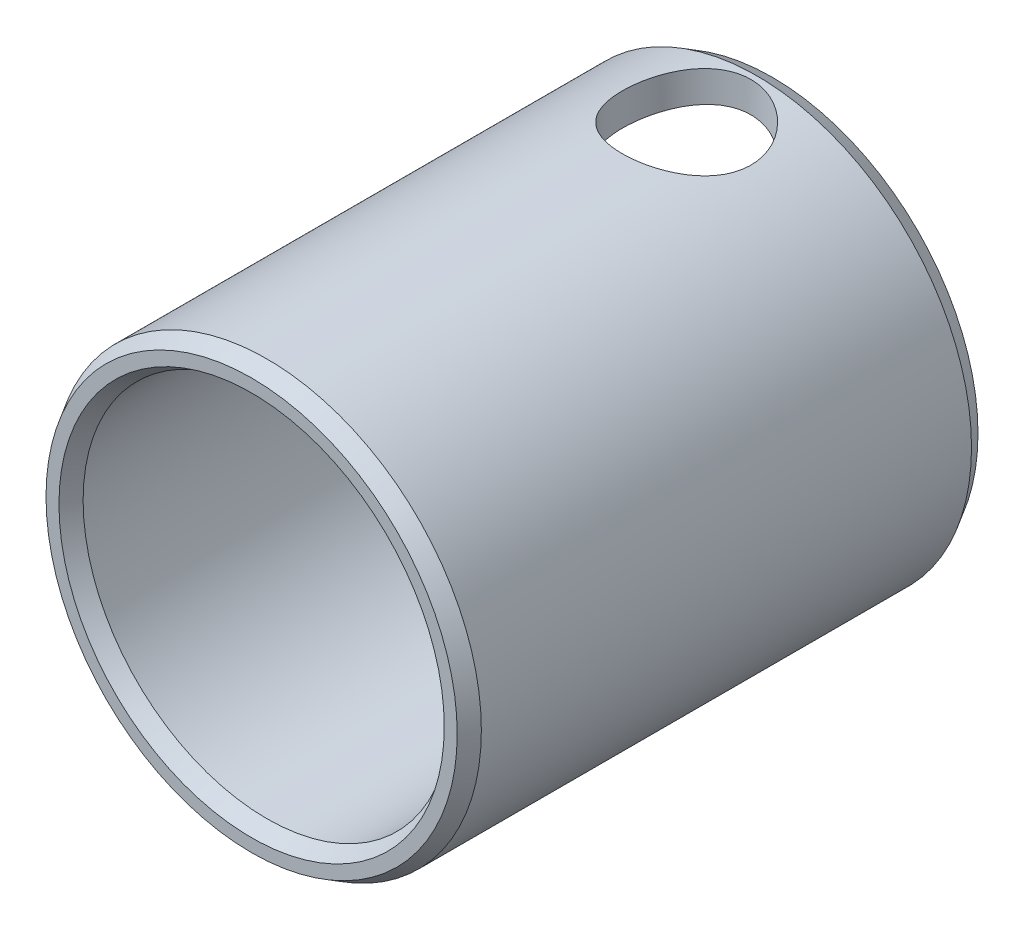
ISO-10303-21;
HEADER;
FILE_DESCRIPTION(('STEP AP214'),'2;1');
FILE_NAME('part.step','',(''),(''),'','','');
FILE_SCHEMA(('AUTOMOTIVE_DESIGN { 1 0 10303 214 1 1 1 1 }'));
ENDSEC;
DATA;
#1=APPLICATION_CONTEXT('core data for automotive mechanical design processes');
#2=APPLICATION_PROTOCOL_DEFINITION('international standard','automotive_design',2000,#1);
#3=PRODUCT_CONTEXT('',#1,'mechanical');
#4=PRODUCT('Part','Part','',(#3));
#5=PRODUCT_RELATED_PRODUCT_CATEGORY('part','',(#4));
#6=PRODUCT_DEFINITION_FORMATION('','',#4);
#7=PRODUCT_DEFINITION_CONTEXT('part definition',#1,'design');
#8=PRODUCT_DEFINITION('design','',#6,#7);
#9=PRODUCT_DEFINITION_SHAPE('','',#8);
#10=(LENGTH_UNIT() NAMED_UNIT(*) SI_UNIT(.MILLI.,.METRE.));
#11=(NAMED_UNIT(*) PLANE_ANGLE_UNIT() SI_UNIT($,.RADIAN.));
#12=(NAMED_UNIT(*) SI_UNIT($,.STERADIAN.) SOLID_ANGLE_UNIT());
#13=UNCERTAINTY_MEASURE_WITH_UNIT(LENGTH_MEASURE(1.E-05),#10,'distance_accuracy_value','');
#14=(GEOMETRIC_REPRESENTATION_CONTEXT(3) GLOBAL_UNCERTAINTY_ASSIGNED_CONTEXT((#13)) GLOBAL_UNIT_ASSIGNED_CONTEXT((#10,
#11,#12)) REPRESENTATION_CONTEXT('',''));
#15=CARTESIAN_POINT('',(0.,0.,0.));
#16=DIRECTION('',(0.,0.,1.));
#17=DIRECTION('',(1.,0.,0.));
#18=AXIS2_PLACEMENT_3D('',#15,#16,#17);
#19=CARTESIAN_POINT('',(0.,0.,18.6351157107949));
#20=DIRECTION('',(0.,0.,1.));
#21=DIRECTION('',(1.,0.,0.));
#22=AXIS2_PLACEMENT_3D('',#19,#20,#21);
#23=CYLINDRICAL_SURFACE('',#22,7.);
#24=CARTESIAN_POINT('',(0.,0.,16.5));
#25=DIRECTION('',(0.,0.,1.));
#26=DIRECTION('',(1.,0.,0.));
#27=AXIS2_PLACEMENT_3D('',#24,#25,#26);
#28=CIRCLE('',#27,7.);
#29=CARTESIAN_POINT('',(7.,0.,16.5));
#30=VERTEX_POINT('',#29);
#31=EDGE_CURVE('E29',#30,#30,#28,.T.);
#32=ORIENTED_EDGE('',*,*,#31,.F.);
#33=EDGE_LOOP('',(#32));
#34=FACE_BOUND('',#33,.T.);
#35=CARTESIAN_POINT('',(0.,0.,0.5));
#36=DIRECTION('',(0.,0.,1.));
#37=DIRECTION('',(1.,0.,0.));
#38=AXIS2_PLACEMENT_3D('',#35,#36,#37);
#39=CIRCLE('',#38,7.);
#40=CARTESIAN_POINT('',(7.,0.,0.5));
#41=VERTEX_POINT('',#40);
#42=EDGE_CURVE('E25',#41,#41,#39,.T.);
#43=ORIENTED_EDGE('',*,*,#42,.T.);
#44=EDGE_LOOP('',(#43));
#45=FACE_BOUND('',#44,.T.);
#46=CARTESIAN_POINT('',(0.,7.,4.9));
#47=CARTESIAN_POINT('',(0.11520405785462,6.9999990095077,4.89999860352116));
#48=CARTESIAN_POINT('',(0.230422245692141,6.99712881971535,4.89048859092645));
#49=CARTESIAN_POINT('',(0.457503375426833,6.98595947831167,4.85279010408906));
#50=CARTESIAN_POINT('',(0.569365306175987,6.97765870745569,4.82459605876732));
#51=CARTESIAN_POINT('',(0.786425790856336,6.95653773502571,4.75055557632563));
#52=CARTESIAN_POINT('',(0.891633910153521,6.94372420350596,4.70473518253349));
#53=CARTESIAN_POINT('',(1.09287385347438,6.91490952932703,4.59684946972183));
#54=CARTESIAN_POINT('',(1.18890445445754,6.89890796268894,4.53478198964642));
#55=CARTESIAN_POINT('',(1.37182051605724,6.86491032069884,4.39428638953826));
#56=CARTESIAN_POINT('',(1.45840529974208,6.84687337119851,4.31547672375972));
#57=CARTESIAN_POINT('',(1.61734889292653,6.81108167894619,4.14454707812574));
#58=CARTESIAN_POINT('',(1.68970530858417,6.79332698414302,4.05242486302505));
#59=CARTESIAN_POINT('',(1.81972052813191,6.75967759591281,3.85494094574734));
#60=CARTESIAN_POINT('',(1.87701232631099,6.74383369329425,3.74932815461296));
#61=CARTESIAN_POINT('',(1.97289952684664,6.71641068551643,3.52941504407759));
#62=CARTESIAN_POINT('',(2.01149941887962,6.70483055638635,3.41511681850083));
#63=CARTESIAN_POINT('',(2.06782287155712,6.68767219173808,3.18445362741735));
#64=CARTESIAN_POINT('',(2.08610074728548,6.68193497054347,3.06823615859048));
#65=CARTESIAN_POINT('',(2.10299222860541,6.67663905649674,2.83425358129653));
#66=CARTESIAN_POINT('',(2.1016105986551,6.677078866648,2.71648885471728));
#67=CARTESIAN_POINT('',(2.07965768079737,6.68394641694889,2.48726252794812));
#68=CARTESIAN_POINT('',(2.05978087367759,6.69015744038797,2.37572684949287));
#69=CARTESIAN_POINT('',(2.00252388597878,6.70751698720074,2.15765229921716));
#70=CARTESIAN_POINT('',(1.96514197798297,6.71866599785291,2.05111392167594));
#71=CARTESIAN_POINT('',(1.87342437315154,6.74481826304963,1.84435951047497));
#72=CARTESIAN_POINT('',(1.81886343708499,6.75987222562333,1.74425008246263));
#73=CARTESIAN_POINT('',(1.69449311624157,6.7921138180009,1.55437516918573));
#74=CARTESIAN_POINT('',(1.62468003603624,6.80930196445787,1.46461219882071));
#75=CARTESIAN_POINT('',(1.46833807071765,6.84475415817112,1.29403933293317));
#76=CARTESIAN_POINT('',(1.38123287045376,6.86303316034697,1.21375987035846));
#77=CARTESIAN_POINT('',(1.19456856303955,6.89797141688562,1.06882442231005));
#78=CARTESIAN_POINT('',(1.09500867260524,6.91463056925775,1.0041694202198));
#79=CARTESIAN_POINT('',(0.885297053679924,6.94460424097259,0.891996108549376));
#80=CARTESIAN_POINT('',(0.775078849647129,6.9578956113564,0.844595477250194));
#81=CARTESIAN_POINT('',(0.547743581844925,6.97946930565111,0.769160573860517));
#82=CARTESIAN_POINT('',(0.430628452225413,6.98775302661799,0.741120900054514));
#83=CARTESIAN_POINT('',(0.197333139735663,6.99815710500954,0.706086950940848));
#84=CARTESIAN_POINT('',(0.0812701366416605,7.00048790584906,0.698373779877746));
#85=CARTESIAN_POINT('',(-0.150499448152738,6.99934092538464,0.702196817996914));
#86=CARTESIAN_POINT('',(-0.266206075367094,6.9958639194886,0.713730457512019));
#87=CARTESIAN_POINT('',(-0.491265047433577,6.98362975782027,0.755138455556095));
#88=CARTESIAN_POINT('',(-0.600701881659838,6.9749936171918,0.784592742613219));
#89=CARTESIAN_POINT('',(-0.813056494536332,6.95344086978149,0.860500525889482));
#90=CARTESIAN_POINT('',(-0.91597348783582,6.94052374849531,0.906956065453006));
#91=CARTESIAN_POINT('',(-1.11501206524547,6.91137516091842,1.01675443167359));
#92=CARTESIAN_POINT('',(-1.21092135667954,6.89507393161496,1.08046307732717));
#93=CARTESIAN_POINT('',(-1.39093263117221,6.86102856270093,1.22251465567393));
#94=CARTESIAN_POINT('',(-1.47503164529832,6.84328406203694,1.30086125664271));
#95=CARTESIAN_POINT('',(-1.63220042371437,6.80754440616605,1.47334223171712));
#96=CARTESIAN_POINT('',(-1.70475873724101,6.78956355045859,1.56794662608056));
#97=CARTESIAN_POINT('',(-1.83300593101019,6.75607121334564,1.76837911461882));
#98=CARTESIAN_POINT('',(-1.88869525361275,6.74055966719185,1.87420691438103));
#99=CARTESIAN_POINT('',(-1.98124285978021,6.71394065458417,2.09374548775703));
#100=CARTESIAN_POINT('',(-2.01818885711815,6.70281272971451,2.20741666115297));
#101=CARTESIAN_POINT('',(-2.07230423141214,6.68628232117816,2.43976315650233));
#102=CARTESIAN_POINT('',(-2.08948038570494,6.68087787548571,2.55843674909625));
#103=CARTESIAN_POINT('',(-2.10310778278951,6.6765996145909,2.79210612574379));
#104=CARTESIAN_POINT('',(-2.10039277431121,6.67746306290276,2.90704911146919));
#105=CARTESIAN_POINT('',(-2.07630507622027,6.68499161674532,3.13475974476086));
#106=CARTESIAN_POINT('',(-2.05493313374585,6.69165648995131,3.24752747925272));
#107=CARTESIAN_POINT('',(-1.9946764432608,6.7098606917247,3.46632355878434));
#108=CARTESIAN_POINT('',(-1.95601245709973,6.72133846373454,3.57241820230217));
#109=CARTESIAN_POINT('',(-1.86244109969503,6.74786390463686,3.77669941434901));
#110=CARTESIAN_POINT('',(-1.80753061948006,6.76291225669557,3.8748844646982));
#111=CARTESIAN_POINT('',(-1.68068269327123,6.79556746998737,4.06442836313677));
#112=CARTESIAN_POINT('',(-1.60819786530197,6.81324756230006,4.15540826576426));
#113=CARTESIAN_POINT('',(-1.44924408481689,6.84881848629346,4.32418349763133));
#114=CARTESIAN_POINT('',(-1.36277150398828,6.8667093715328,4.40197539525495));
#115=CARTESIAN_POINT('',(-1.17525206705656,6.90131311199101,4.54443277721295));
#116=CARTESIAN_POINT('',(-1.07385304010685,6.91797623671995,4.60864802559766));
#117=CARTESIAN_POINT('',(-0.861197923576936,6.94764952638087,4.71902923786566));
#118=CARTESIAN_POINT('',(-0.749946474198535,6.9606613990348,4.76520364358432));
#119=CARTESIAN_POINT('',(-0.533060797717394,6.98043044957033,4.83405338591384));
#120=CARTESIAN_POINT('',(-0.428101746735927,6.98770838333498,4.85871634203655));
#121=CARTESIAN_POINT('',(-0.21543227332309,6.99749322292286,4.89168893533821));
#122=CARTESIAN_POINT('',(-0.107722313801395,7.00000092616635,4.90000130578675));
#123=CARTESIAN_POINT('',(0.,7.,4.9));
#124=B_SPLINE_CURVE_WITH_KNOTS('',3,(#46,#47,#48,#49,#50,#51,#52,#53,#54,#55,#56,#57,#58,#59,
#60,#61,#62,#63,#64,#65,#66,#67,#68,#69,#70,#71,#72,#73,#74,#75,#76,#77,#78,#79,#80,#81,#82,#83,
#84,#85,#86,#87,#88,#89,#90,#91,#92,#93,#94,#95,#96,#97,#98,#99,#100,#101,#102,#103,#104,#105,
#106,#107,#108,#109,#110,#111,#112,#113,#114,#115,#116,#117,#118,#119,#120,#121,#122,#123),
.UNSPECIFIED.,.T.,.F.,(4,2,2,2,2,2,2,2,2,2,2,2,2,2,2,2,2,2,2,2,2,2,2,2,2,2,2,2,2,2,2,2,2,2,2,2,
2,2,4),(0.,0.345216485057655,0.690535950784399,1.03534714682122,1.38020423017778,
1.73397844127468,2.08781212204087,2.44960073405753,2.81130240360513,3.16287565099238,
3.51436369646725,3.85316423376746,4.19199821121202,4.53547397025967,4.87903304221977,
5.23693945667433,5.594868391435,5.95519465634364,6.31542034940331,6.66272333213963,
7.00997994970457,7.34939445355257,7.6888497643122,8.03615827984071,8.38355394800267,
8.74356560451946,9.10356781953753,9.46186940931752,9.82004813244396,10.1633021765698,
10.5065424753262,10.8455205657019,11.1845635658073,11.5359569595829,11.8874416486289,
12.2492019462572,12.6107927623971,12.9336436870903,13.2564406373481),.UNSPECIFIED.);
#125=CARTESIAN_POINT('',(0.,7.,4.9));
#126=VERTEX_POINT('',#125);
#127=EDGE_CURVE('E49',#126,#126,#124,.T.);
#128=ORIENTED_EDGE('',*,*,#127,.F.);
#129=EDGE_LOOP('',(#128));
#130=FACE_BOUND('',#129,.T.);
#131=ADVANCED_FACE('F12',(#34,#45,#130),#23,.T.);
#132=CARTESIAN_POINT('',(0.,0.,18.6351157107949));
#133=DIRECTION('',(0.,0.,1.));
#134=DIRECTION('',(1.,0.,0.));
#135=AXIS2_PLACEMENT_3D('',#132,#133,#134);
#136=CYLINDRICAL_SURFACE('',#135,6.);
#137=CARTESIAN_POINT('',(0.,0.,16.5));
#138=DIRECTION('',(0.,0.,1.));
#139=DIRECTION('',(1.,0.,0.));
#140=AXIS2_PLACEMENT_3D('',#137,#138,#139);
#141=CIRCLE('',#140,6.);
#142=CARTESIAN_POINT('',(6.,0.,16.5));
#143=VERTEX_POINT('',#142);
#144=EDGE_CURVE('E40',#143,#143,#141,.T.);
#145=ORIENTED_EDGE('',*,*,#144,.T.);
#146=EDGE_LOOP('',(#145));
#147=FACE_BOUND('',#146,.T.);
#148=CARTESIAN_POINT('',(0.,0.,0.5));
#149=DIRECTION('',(0.,0.,1.));
#150=DIRECTION('',(1.,0.,0.));
#151=AXIS2_PLACEMENT_3D('',#148,#149,#150);
#152=CIRCLE('',#151,6.);
#153=CARTESIAN_POINT('',(6.,0.,0.5));
#154=VERTEX_POINT('',#153);
#155=EDGE_CURVE('E43',#154,#154,#152,.T.);
#156=ORIENTED_EDGE('',*,*,#155,.F.);
#157=EDGE_LOOP('',(#156));
#158=FACE_BOUND('',#157,.T.);
#159=CARTESIAN_POINT('',(0.,6.,4.9));
#160=CARTESIAN_POINT('',(-0.114251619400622,6.00000124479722,4.90000177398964));
#161=CARTESIAN_POINT('',(-0.228490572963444,5.99670718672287,4.89064619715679));
#162=CARTESIAN_POINT('',(-0.453584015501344,5.98389272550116,4.85359972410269));
#163=CARTESIAN_POINT('',(-0.564438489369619,5.97437229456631,4.82590874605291));
#164=CARTESIAN_POINT('',(-0.779485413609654,5.95013476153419,4.75327063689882));
#165=CARTESIAN_POINT('',(-0.88368929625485,5.9354268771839,4.70835410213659));
#166=CARTESIAN_POINT('',(-1.0830819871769,5.9023013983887,4.60268493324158));
#167=CARTESIAN_POINT('',(-1.17826873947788,5.88388296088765,4.54192869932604));
#168=CARTESIAN_POINT('',(-1.36051553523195,5.8444837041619,4.40390289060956));
#169=CARTESIAN_POINT('',(-1.44718917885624,5.82343705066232,4.32614204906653));
#170=CARTESIAN_POINT('',(-1.60656711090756,5.78150036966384,4.15735799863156));
#171=CARTESIAN_POINT('',(-1.67926788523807,5.76061038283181,4.06633146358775));
#172=CARTESIAN_POINT('',(-1.81093773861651,5.72061212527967,3.8700072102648));
#173=CARTESIAN_POINT('',(-1.86938779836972,5.70158313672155,3.76434366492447));
#174=CARTESIAN_POINT('',(-1.96751959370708,5.66847146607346,3.54391324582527));
#175=CARTESIAN_POINT('',(-2.00720773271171,5.65438709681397,3.42914949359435));
#176=CARTESIAN_POINT('',(-2.0652098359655,5.63345661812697,3.198194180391));
#177=CARTESIAN_POINT('',(-2.08425340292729,5.62636429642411,3.08220886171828));
#178=CARTESIAN_POINT('',(-2.10270718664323,5.61949543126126,2.8484889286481));
#179=CARTESIAN_POINT('',(-2.10212422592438,5.61971634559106,2.73075493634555));
#180=CARTESIAN_POINT('',(-2.08190459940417,5.62723456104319,2.50327032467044));
#181=CARTESIAN_POINT('',(-2.06324229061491,5.63416998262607,2.39341901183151));
#182=CARTESIAN_POINT('',(-2.008991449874,5.65374002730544,2.17851855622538));
#183=CARTESIAN_POINT('',(-1.97340069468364,5.66637539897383,2.07347004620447));
#184=CARTESIAN_POINT('',(-1.88570622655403,5.69616366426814,1.86903257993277));
#185=CARTESIAN_POINT('',(-1.83332799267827,5.71339079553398,1.76977266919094));
#186=CARTESIAN_POINT('',(-1.71373613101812,5.750392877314,1.58115283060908));
#187=CARTESIAN_POINT('',(-1.64651787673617,5.77016862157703,1.49179600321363));
#188=CARTESIAN_POINT('',(-1.49456039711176,5.81143944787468,1.32007406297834));
#189=CARTESIAN_POINT('',(-1.4090316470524,5.83296775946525,1.23841405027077));
#190=CARTESIAN_POINT('',(-1.22523410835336,5.87432244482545,1.09040207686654));
#191=CARTESIAN_POINT('',(-1.12696383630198,5.89414861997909,1.02405190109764));
#192=CARTESIAN_POINT('',(-0.918860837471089,5.93017388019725,0.907896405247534));
#193=CARTESIAN_POINT('',(-0.808904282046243,5.94632692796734,0.858297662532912));
#194=CARTESIAN_POINT('',(-0.581505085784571,5.97284929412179,0.778526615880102));
#195=CARTESIAN_POINT('',(-0.464065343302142,5.98322083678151,0.748346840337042));
#196=CARTESIAN_POINT('',(-0.230989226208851,5.99663436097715,0.709560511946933));
#197=CARTESIAN_POINT('',(-0.115529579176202,5.99999933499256,0.700002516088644));
#198=CARTESIAN_POINT('',(0.115377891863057,6.00000066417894,0.699997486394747));
#199=CARTESIAN_POINT('',(0.230825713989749,5.99663828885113,0.709546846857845));
#200=CARTESIAN_POINT('',(0.454507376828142,5.98377619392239,0.746743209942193));
#201=CARTESIAN_POINT('',(0.562853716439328,5.97447978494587,0.773791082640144));
#202=CARTESIAN_POINT('',(0.773415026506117,5.95088754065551,0.844452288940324));
#203=CARTESIAN_POINT('',(0.875629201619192,5.93659105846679,0.888067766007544));
#204=CARTESIAN_POINT('',(1.0741840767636,5.90394255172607,0.991954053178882));
#205=CARTESIAN_POINT('',(1.17028394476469,5.88548924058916,1.05265239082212));
#206=CARTESIAN_POINT('',(1.35123467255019,5.84660110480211,1.18848710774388));
#207=CARTESIAN_POINT('',(1.43608178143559,5.82616562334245,1.26362828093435));
#208=CARTESIAN_POINT('',(1.59657189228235,5.78430503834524,1.43068012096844));
#209=CARTESIAN_POINT('',(1.67153670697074,5.76288189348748,1.52324446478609));
#210=CARTESIAN_POINT('',(1.80497245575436,5.72249507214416,1.7200875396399));
#211=CARTESIAN_POINT('',(1.86344281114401,5.70353148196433,1.82436668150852));
#212=CARTESIAN_POINT('',(1.96206588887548,5.67036332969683,2.0420003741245));
#213=CARTESIAN_POINT('',(2.00221823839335,5.65615886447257,2.15535510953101));
#214=CARTESIAN_POINT('',(2.06265099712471,5.63440525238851,2.38783927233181));
#215=CARTESIAN_POINT('',(2.08294160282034,5.62685269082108,2.50696570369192));
#216=CARTESIAN_POINT('',(2.10223163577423,5.61967236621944,2.74037219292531));
#217=CARTESIAN_POINT('',(2.10236838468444,5.61962128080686,2.85454617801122));
#218=CARTESIAN_POINT('',(2.08419060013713,5.62638796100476,3.08119757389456));
#219=CARTESIAN_POINT('',(2.06587739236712,5.63320523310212,3.19367510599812));
#220=CARTESIAN_POINT('',(2.01215791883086,5.65261016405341,3.4111305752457));
#221=CARTESIAN_POINT('',(1.97715663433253,5.66506076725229,3.51622178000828));
#222=CARTESIAN_POINT('',(1.89139271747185,5.69426693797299,3.71911485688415));
#223=CARTESIAN_POINT('',(1.84062637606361,5.71102351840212,3.81691500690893));
#224=CARTESIAN_POINT('',(1.72198212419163,5.74793925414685,4.00746074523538));
#225=CARTESIAN_POINT('',(1.65340944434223,5.76822170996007,4.09974964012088));
#226=CARTESIAN_POINT('',(1.50223440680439,5.80942536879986,4.27187657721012));
#227=CARTESIAN_POINT('',(1.41962789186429,5.83034675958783,4.35171091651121));
#228=CARTESIAN_POINT('',(1.23831189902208,5.87159201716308,4.50027026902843));
#229=CARTESIAN_POINT('',(1.13904838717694,5.89184757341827,4.56834067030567));
#230=CARTESIAN_POINT('',(0.929800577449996,5.92846815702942,4.68677409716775));
#231=CARTESIAN_POINT('',(0.819817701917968,5.94483369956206,4.73713946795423));
#232=CARTESIAN_POINT('',(0.593417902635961,5.97165768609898,4.81795433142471));
#233=CARTESIAN_POINT('',(0.477083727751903,5.98217829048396,4.84861396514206));
#234=CARTESIAN_POINT('',(0.240494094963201,5.99634758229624,4.88963229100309));
#235=CARTESIAN_POINT('',(0.120240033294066,5.99999868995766,4.89999813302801));
#236=CARTESIAN_POINT('',(0.,6.,4.9));
#237=B_SPLINE_CURVE_WITH_KNOTS('',3,(#159,#160,#161,#162,#163,#164,#165,#166,#167,#168,#169,
#170,#171,#172,#173,#174,#175,#176,#177,#178,#179,#180,#181,#182,#183,#184,#185,#186,#187,#188,
#189,#190,#191,#192,#193,#194,#195,#196,#197,#198,#199,#200,#201,#202,#203,#204,#205,#206,#207,
#208,#209,#210,#211,#212,#213,#214,#215,#216,#217,#218,#219,#220,#221,#222,#223,#224,#225,#226,
#227,#228,#229,#230,#231,#232,#233,#234,#235,#236),.UNSPECIFIED.,.T.,.F.,(4,2,2,2,2,2,2,2,2,2,2,
2,2,2,2,2,2,2,2,2,2,2,2,2,2,2,2,2,2,2,2,2,2,2,2,2,2,2,4),(0.,0.34231196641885,0.684625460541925,
1.02633372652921,1.36811971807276,1.72152774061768,2.07502452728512,2.43993230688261,
2.80471545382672,3.15613820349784,3.50743879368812,3.8408028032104,4.17421060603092,
4.51337542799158,4.85264613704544,5.21157468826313,5.57054506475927,5.93379308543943,
6.2969012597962,6.6428625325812,6.98875852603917,7.32339682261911,7.65807842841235,
8.00202226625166,8.3460804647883,8.70745545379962,9.06884312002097,9.43023814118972,
9.79144753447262,10.1322648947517,10.4730577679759,10.8059714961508,11.1389636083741,
11.4876784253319,11.8364967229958,12.2008786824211,12.565212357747,12.925593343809,
13.2858473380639),.UNSPECIFIED.);
#238=CARTESIAN_POINT('',(0.,6.,4.9));
#239=VERTEX_POINT('',#238);
#240=EDGE_CURVE('E16',#239,#239,#237,.T.);
#241=ORIENTED_EDGE('',*,*,#240,.F.);
#242=EDGE_LOOP('',(#241));
#243=FACE_BOUND('',#242,.T.);
#244=ADVANCED_FACE('F67',(#147,#158,#243),#136,.F.);
#245=CARTESIAN_POINT('',(0.,-6.2886751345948,0.));
#246=DIRECTION('',(0.,0.,1.));
#247=DIRECTION('',(1.,0.,0.));
#248=AXIS2_PLACEMENT_3D('',#245,#246,#247);
#249=PLANE('',#248);
#250=CARTESIAN_POINT('',(0.,0.,0.));
#251=DIRECTION('',(0.,0.,1.));
#252=DIRECTION('',(1.,0.,0.));
#253=AXIS2_PLACEMENT_3D('',#250,#251,#252);
#254=CIRCLE('',#253,6.71132486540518);
#255=CARTESIAN_POINT('',(6.71132486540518,0.,0.));
#256=VERTEX_POINT('',#255);
#257=EDGE_CURVE('E8',#256,#256,#254,.T.);
#258=ORIENTED_EDGE('',*,*,#257,.F.);
#259=EDGE_LOOP('',(#258));
#260=FACE_BOUND('',#259,.T.);
#261=CARTESIAN_POINT('',(0.,0.,0.));
#262=DIRECTION('',(0.,0.,1.));
#263=DIRECTION('',(1.,0.,0.));
#264=AXIS2_PLACEMENT_3D('',#261,#262,#263);
#265=CIRCLE('',#264,6.28867513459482);
#266=CARTESIAN_POINT('',(6.28867513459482,0.,0.));
#267=VERTEX_POINT('',#266);
#268=EDGE_CURVE('E46',#267,#267,#265,.T.);
#269=ORIENTED_EDGE('',*,*,#268,.T.);
#270=EDGE_LOOP('',(#269));
#271=FACE_BOUND('',#270,.T.);
#272=ADVANCED_FACE('F14',(#260,#271),#249,.F.);
#273=CARTESIAN_POINT('',(0.,0.,0.5));
#274=DIRECTION('',(0.,0.,1.));
#275=DIRECTION('',(1.,0.,0.));
#276=AXIS2_PLACEMENT_3D('',#273,#274,#275);
#277=CONICAL_SURFACE('',#276,7.,0.523598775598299);
#278=ORIENTED_EDGE('',*,*,#257,.T.);
#279=EDGE_LOOP('',(#278));
#280=FACE_BOUND('',#279,.T.);
#281=ORIENTED_EDGE('',*,*,#42,.F.);
#282=EDGE_LOOP('',(#281));
#283=FACE_BOUND('',#282,.T.);
#284=ADVANCED_FACE('F80',(#280,#283),#277,.T.);
#285=CARTESIAN_POINT('',(0.,0.,16.5));
#286=DIRECTION('',(0.,0.,-1.));
#287=DIRECTION('',(-1.,0.,0.));
#288=AXIS2_PLACEMENT_3D('',#285,#286,#287);
#289=CONICAL_SURFACE('',#288,7.,0.5235987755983);
#290=CARTESIAN_POINT('',(0.,0.,17.));
#291=DIRECTION('',(0.,0.,1.));
#292=DIRECTION('',(1.,0.,0.));
#293=AXIS2_PLACEMENT_3D('',#290,#291,#292);
#294=CIRCLE('',#293,6.71132486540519);
#295=CARTESIAN_POINT('',(6.71132486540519,0.,17.));
#296=VERTEX_POINT('',#295);
#297=EDGE_CURVE('E34',#296,#296,#294,.T.);
#298=ORIENTED_EDGE('',*,*,#297,.F.);
#299=EDGE_LOOP('',(#298));
#300=FACE_BOUND('',#299,.T.);
#301=ORIENTED_EDGE('',*,*,#31,.T.);
#302=EDGE_LOOP('',(#301));
#303=FACE_BOUND('',#302,.T.);
#304=ADVANCED_FACE('F77',(#300,#303),#289,.T.);
#305=CARTESIAN_POINT('',(0.,-6.7113248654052,17.));
#306=DIRECTION('',(0.,0.,-1.));
#307=DIRECTION('',(-1.,0.,0.));
#308=AXIS2_PLACEMENT_3D('',#305,#306,#307);
#309=PLANE('',#308);
#310=CARTESIAN_POINT('',(0.,0.,17.));
#311=DIRECTION('',(0.,0.,1.));
#312=DIRECTION('',(1.,0.,0.));
#313=AXIS2_PLACEMENT_3D('',#310,#311,#312);
#314=CIRCLE('',#313,6.28867513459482);
#315=CARTESIAN_POINT('',(6.28867513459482,0.,17.));
#316=VERTEX_POINT('',#315);
#317=EDGE_CURVE('E37',#316,#316,#314,.T.);
#318=ORIENTED_EDGE('',*,*,#317,.F.);
#319=EDGE_LOOP('',(#318));
#320=FACE_BOUND('',#319,.T.);
#321=ORIENTED_EDGE('',*,*,#297,.T.);
#322=EDGE_LOOP('',(#321));
#323=FACE_BOUND('',#322,.T.);
#324=ADVANCED_FACE('F74',(#320,#323),#309,.F.);
#325=CARTESIAN_POINT('',(0.,0.,17.));
#326=DIRECTION('',(0.,0.,1.));
#327=DIRECTION('',(1.,0.,0.));
#328=AXIS2_PLACEMENT_3D('',#325,#326,#327);
#329=CONICAL_SURFACE('',#328,6.28867513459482,0.523598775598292);
#330=ORIENTED_EDGE('',*,*,#144,.F.);
#331=EDGE_LOOP('',(#330));
#332=FACE_BOUND('',#331,.T.);
#333=ORIENTED_EDGE('',*,*,#317,.T.);
#334=EDGE_LOOP('',(#333));
#335=FACE_BOUND('',#334,.T.);
#336=ADVANCED_FACE('F65',(#332,#335),#329,.F.);
#337=CARTESIAN_POINT('',(0.,0.,0.));
#338=DIRECTION('',(0.,0.,-1.));
#339=DIRECTION('',(-1.,0.,0.));
#340=AXIS2_PLACEMENT_3D('',#337,#338,#339);
#341=CONICAL_SURFACE('',#340,6.28867513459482,0.523598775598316);
#342=ORIENTED_EDGE('',*,*,#155,.T.);
#343=EDGE_LOOP('',(#342));
#344=FACE_BOUND('',#343,.T.);
#345=ORIENTED_EDGE('',*,*,#268,.F.);
#346=EDGE_LOOP('',(#345));
#347=FACE_BOUND('',#346,.T.);
#348=ADVANCED_FACE('F61',(#344,#347),#341,.F.);
#349=CARTESIAN_POINT('',(0.,10.,2.8));
#350=DIRECTION('',(0.,-1.,0.));
#351=DIRECTION('',(0.,0.,1.));
#352=AXIS2_PLACEMENT_3D('',#349,#350,#351);
#353=CYLINDRICAL_SURFACE('',#352,2.1);
#354=ORIENTED_EDGE('',*,*,#240,.T.);
#355=EDGE_LOOP('',(#354));
#356=FACE_BOUND('',#355,.T.);
#357=ORIENTED_EDGE('',*,*,#127,.T.);
#358=EDGE_LOOP('',(#357));
#359=FACE_BOUND('',#358,.T.);
#360=ADVANCED_FACE('F57',(#356,#359),#353,.F.);
#361=CLOSED_SHELL('',(#131,#244,#272,#284,#304,#324,#336,#348,#360));
#362=MANIFOLD_SOLID_BREP('B1',#361);
#363=ADVANCED_BREP_SHAPE_REPRESENTATION('',(#18,#362),#14);
#364=SHAPE_DEFINITION_REPRESENTATION(#9,#363);
ENDSEC;
END-ISO-10303-21;
